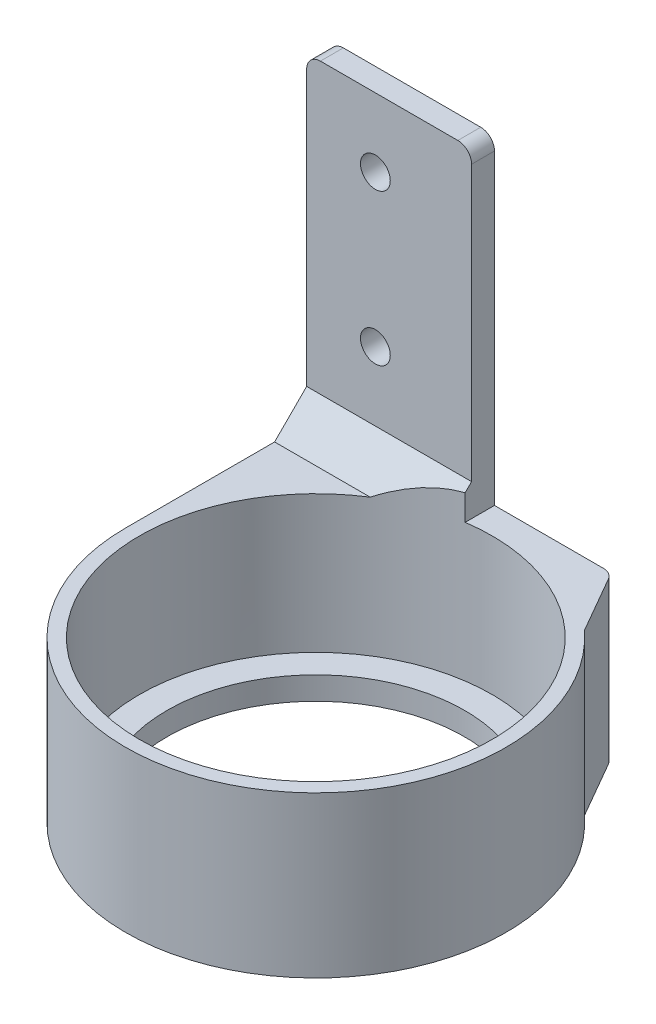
ISO-10303-21;
HEADER;
FILE_DESCRIPTION(('STEP AP214'),'2;1');
FILE_NAME('part.step','',(''),(''),'','','');
FILE_SCHEMA(('AUTOMOTIVE_DESIGN { 1 0 10303 214 1 1 1 1 }'));
ENDSEC;
DATA;
#1=APPLICATION_CONTEXT('core data for automotive mechanical design processes');
#2=APPLICATION_PROTOCOL_DEFINITION('international standard','automotive_design',2000,#1);
#3=PRODUCT_CONTEXT('',#1,'mechanical');
#4=PRODUCT('Part','Part','',(#3));
#5=PRODUCT_RELATED_PRODUCT_CATEGORY('part','',(#4));
#6=PRODUCT_DEFINITION_FORMATION('','',#4);
#7=PRODUCT_DEFINITION_CONTEXT('part definition',#1,'design');
#8=PRODUCT_DEFINITION('design','',#6,#7);
#9=PRODUCT_DEFINITION_SHAPE('','',#8);
#10=(LENGTH_UNIT() NAMED_UNIT(*) SI_UNIT(.MILLI.,.METRE.));
#11=(NAMED_UNIT(*) PLANE_ANGLE_UNIT() SI_UNIT($,.RADIAN.));
#12=(NAMED_UNIT(*) SI_UNIT($,.STERADIAN.) SOLID_ANGLE_UNIT());
#13=UNCERTAINTY_MEASURE_WITH_UNIT(LENGTH_MEASURE(1.E-05),#10,'distance_accuracy_value','');
#14=(GEOMETRIC_REPRESENTATION_CONTEXT(3) GLOBAL_UNCERTAINTY_ASSIGNED_CONTEXT((#13)) GLOBAL_UNIT_ASSIGNED_CONTEXT((#10,
#11,#12)) REPRESENTATION_CONTEXT('',''));
#15=CARTESIAN_POINT('',(0.,0.,0.));
#16=DIRECTION('',(0.,0.,1.));
#17=DIRECTION('',(1.,0.,0.));
#18=AXIS2_PLACEMENT_3D('',#15,#16,#17);
#19=CARTESIAN_POINT('',(36.,-3.00000000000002,3.));
#20=DIRECTION('',(-1.,0.,0.));
#21=DIRECTION('',(0.,-1.,0.));
#22=AXIS2_PLACEMENT_3D('',#19,#20,#21);
#23=PLANE('',#22);
#24=DIRECTION('',(0.,-1.,0.));
#25=VECTOR('',#24,1.);
#26=CARTESIAN_POINT('',(36.,-60.,6.39488223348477));
#27=LINE('',#26,#25);
#28=CARTESIAN_POINT('',(36.,-70.,6.39488223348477));
#29=VERTEX_POINT('',#28);
#30=CARTESIAN_POINT('',(36.,-64.3948822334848,6.39488223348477));
#31=VERTEX_POINT('',#30);
#32=EDGE_CURVE('E68',#29,#31,#27,.F.);
#33=ORIENTED_EDGE('',*,*,#32,.F.);
#34=DIRECTION('',(0.,0.,-1.));
#35=VECTOR('',#34,1.);
#36=CARTESIAN_POINT('',(36.,-70.,3.));
#37=LINE('',#36,#35);
#38=CARTESIAN_POINT('',(36.,-70.,0.));
#39=VERTEX_POINT('',#38);
#40=EDGE_CURVE('E143',#29,#39,#37,.T.);
#41=ORIENTED_EDGE('',*,*,#40,.T.);
#42=DIRECTION('',(0.,1.,0.));
#43=VECTOR('',#42,1.);
#44=CARTESIAN_POINT('',(36.,-3.00000000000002,0.));
#45=LINE('',#44,#43);
#46=CARTESIAN_POINT('',(36.,-3.00000000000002,0.));
#47=VERTEX_POINT('',#46);
#48=EDGE_CURVE('E210',#39,#47,#45,.T.);
#49=ORIENTED_EDGE('',*,*,#48,.T.);
#50=DIRECTION('',(0.,0.,-1.));
#51=VECTOR('',#50,1.);
#52=CARTESIAN_POINT('',(36.,-3.00000000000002,3.));
#53=LINE('',#52,#51);
#54=CARTESIAN_POINT('',(36.,-3.00000000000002,5.));
#55=VERTEX_POINT('',#54);
#56=EDGE_CURVE('E244',#55,#47,#53,.T.);
#57=ORIENTED_EDGE('',*,*,#56,.F.);
#58=DIRECTION('',(0.,1.,0.));
#59=VECTOR('',#58,1.);
#60=CARTESIAN_POINT('',(36.,-3.00000000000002,5.));
#61=LINE('',#60,#59);
#62=CARTESIAN_POINT('',(36.,-63.,5.));
#63=VERTEX_POINT('',#62);
#64=EDGE_CURVE('E330',#63,#55,#61,.T.);
#65=ORIENTED_EDGE('',*,*,#64,.F.);
#66=DIRECTION('',(0.,0.707106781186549,-0.707106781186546));
#67=VECTOR('',#66,1.);
#68=CARTESIAN_POINT('',(36.,-63.,5.));
#69=LINE('',#68,#67);
#70=EDGE_CURVE('E146',#31,#63,#69,.T.);
#71=ORIENTED_EDGE('',*,*,#70,.F.);
#72=EDGE_LOOP('',(#33,#41,#49,#57,#65,#71));
#73=FACE_BOUND('',#72,.T.);
#74=ADVANCED_FACE('F52',(#73),#23,.F.);
#75=CARTESIAN_POINT('',(36.,-63.,5.));
#76=DIRECTION('',(0.,0.707106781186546,0.707106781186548));
#77=DIRECTION('',(0.,-0.707106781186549,0.707106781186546));
#78=AXIS2_PLACEMENT_3D('',#75,#76,#77);
#79=PLANE('',#78);
#80=DIRECTION('',(-1.,0.,0.));
#81=VECTOR('',#80,1.);
#82=CARTESIAN_POINT('',(36.,-70.,12.));
#83=LINE('',#82,#81);
#84=CARTESIAN_POINT('',(20.8602325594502,-70.,12.));
#85=VERTEX_POINT('',#84);
#86=CARTESIAN_POINT('',(0.,-70.,12.));
#87=VERTEX_POINT('',#86);
#88=EDGE_CURVE('E75',#85,#87,#83,.T.);
#89=ORIENTED_EDGE('',*,*,#88,.F.);
#90=CARTESIAN_POINT('',(41.5000000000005,-102.5,44.5));
#91=DIRECTION('',(0.,0.707106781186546,0.707106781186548));
#92=DIRECTION('',(0.,-0.707106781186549,0.707106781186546));
#93=AXIS2_PLACEMENT_3D('',#90,#91,#92);
#94=ELLIPSE('',#93,54.4472221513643,38.5);
#95=EDGE_CURVE('E12',#85,#31,#94,.F.);
#96=ORIENTED_EDGE('',*,*,#95,.T.);
#97=ORIENTED_EDGE('',*,*,#70,.T.);
#98=DIRECTION('',(-1.,0.,0.));
#99=VECTOR('',#98,1.);
#100=CARTESIAN_POINT('',(36.,-63.,5.));
#101=LINE('',#100,#99);
#102=CARTESIAN_POINT('',(0.,-63.,5.));
#103=VERTEX_POINT('',#102);
#104=EDGE_CURVE('E349',#63,#103,#101,.T.);
#105=ORIENTED_EDGE('',*,*,#104,.T.);
#106=DIRECTION('',(0.,0.707106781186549,-0.707106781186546));
#107=VECTOR('',#106,1.);
#108=CARTESIAN_POINT('',(0.,-63.,5.));
#109=LINE('',#108,#107);
#110=EDGE_CURVE('E148',#87,#103,#109,.T.);
#111=ORIENTED_EDGE('',*,*,#110,.F.);
#112=EDGE_LOOP('',(#89,#96,#97,#105,#111));
#113=FACE_BOUND('',#112,.T.);
#114=ADVANCED_FACE('F280',(#113),#79,.T.);
#115=CARTESIAN_POINT('',(41.5,-70.,44.5));
#116=DIRECTION('',(0.,-1.,0.));
#117=DIRECTION('',(0.,0.,-1.));
#118=AXIS2_PLACEMENT_3D('',#115,#116,#117);
#119=PLANE('',#118);
#120=CARTESIAN_POINT('',(41.5000000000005,-70.,44.5));
#121=DIRECTION('',(0.,-1.,0.));
#122=DIRECTION('',(0.,0.,-1.));
#123=AXIS2_PLACEMENT_3D('',#120,#121,#122);
#124=CIRCLE('',#123,38.5);
#125=EDGE_CURVE('E152',#29,#85,#124,.T.);
#126=ORIENTED_EDGE('',*,*,#125,.T.);
#127=ORIENTED_EDGE('',*,*,#88,.T.);
#128=DIRECTION('',(0.,0.,-1.));
#129=VECTOR('',#128,1.);
#130=CARTESIAN_POINT('',(0.,-70.,3.));
#131=LINE('',#130,#129);
#132=CARTESIAN_POINT('',(0.,-70.,44.5000000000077));
#133=VERTEX_POINT('',#132);
#134=EDGE_CURVE('E185',#133,#87,#131,.T.);
#135=ORIENTED_EDGE('',*,*,#134,.F.);
#136=CARTESIAN_POINT('',(41.5,-70.,44.5));
#137=DIRECTION('',(0.,-1.,0.));
#138=DIRECTION('',(0.,0.,-1.));
#139=AXIS2_PLACEMENT_3D('',#136,#137,#138);
#140=CIRCLE('',#139,41.5);
#141=CARTESIAN_POINT('',(69.453110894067,-69.9999999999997,13.826337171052));
#142=VERTEX_POINT('',#141);
#143=EDGE_CURVE('E61',#142,#133,#140,.T.);
#144=ORIENTED_EDGE('',*,*,#143,.F.);
#145=DIRECTION('',(-0.498610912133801,0.,-0.866825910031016));
#146=VECTOR('',#145,1.);
#147=CARTESIAN_POINT('',(46.2103102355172,-69.9999999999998,-26.5808447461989));
#148=LINE('',#147,#146);
#149=CARTESIAN_POINT('',(62.3652189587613,-70.,1.50416726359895));
#150=VERTEX_POINT('',#149);
#151=EDGE_CURVE('E249',#142,#150,#148,.T.);
#152=ORIENTED_EDGE('',*,*,#151,.T.);
#153=CARTESIAN_POINT('',(59.7647412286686,-70.,3.));
#154=DIRECTION('',(0.,1.,0.));
#155=DIRECTION('',(0.,0.,1.));
#156=AXIS2_PLACEMENT_3D('',#153,#154,#155);
#157=CIRCLE('',#156,2.99999999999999);
#158=CARTESIAN_POINT('',(59.7647412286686,-70.,0.));
#159=VERTEX_POINT('',#158);
#160=EDGE_CURVE('E313',#159,#150,#157,.F.);
#161=ORIENTED_EDGE('',*,*,#160,.F.);
#162=DIRECTION('',(1.,0.,0.));
#163=VECTOR('',#162,1.);
#164=CARTESIAN_POINT('',(36.,-70.,0.));
#165=LINE('',#164,#163);
#166=EDGE_CURVE('E155',#39,#159,#165,.T.);
#167=ORIENTED_EDGE('',*,*,#166,.F.);
#168=ORIENTED_EDGE('',*,*,#40,.F.);
#169=EDGE_LOOP('',(#126,#127,#135,#144,#152,#161,#167,#168));
#170=FACE_BOUND('',#169,.T.);
#171=ADVANCED_FACE('F151',(#170),#119,.F.);
#172=CARTESIAN_POINT('',(41.5,-105.,44.5));
#173=DIRECTION('',(0.,-1.,0.));
#174=DIRECTION('',(0.,0.,-1.));
#175=AXIS2_PLACEMENT_3D('',#172,#173,#174);
#176=PLANE('',#175);
#177=CARTESIAN_POINT('',(41.5000000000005,-105.,44.5));
#178=DIRECTION('',(0.,1.,0.));
#179=DIRECTION('',(0.,0.,1.));
#180=AXIS2_PLACEMENT_3D('',#177,#178,#179);
#181=CIRCLE('',#180,32.5);
#182=CARTESIAN_POINT('',(41.5000000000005,-105.,77.));
#183=VERTEX_POINT('',#182);
#184=EDGE_CURVE('E168',#183,#183,#181,.T.);
#185=ORIENTED_EDGE('',*,*,#184,.T.);
#186=EDGE_LOOP('',(#185));
#187=FACE_BOUND('',#186,.T.);
#188=CARTESIAN_POINT('',(59.7647412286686,-105.,3.));
#189=DIRECTION('',(0.,1.,0.));
#190=DIRECTION('',(0.,0.,1.));
#191=AXIS2_PLACEMENT_3D('',#188,#189,#190);
#192=CIRCLE('',#191,2.99999999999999);
#193=CARTESIAN_POINT('',(59.7647412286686,-105.,0.));
#194=VERTEX_POINT('',#193);
#195=CARTESIAN_POINT('',(62.3652189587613,-105.,1.50416726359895));
#196=VERTEX_POINT('',#195);
#197=EDGE_CURVE('E309',#194,#196,#192,.F.);
#198=ORIENTED_EDGE('',*,*,#197,.T.);
#199=DIRECTION('',(-0.498610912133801,0.,-0.866825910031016));
#200=VECTOR('',#199,1.);
#201=CARTESIAN_POINT('',(46.2103102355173,-105.,-26.5808447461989));
#202=LINE('',#201,#200);
#203=CARTESIAN_POINT('',(69.4531108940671,-105.,13.826337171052));
#204=VERTEX_POINT('',#203);
#205=EDGE_CURVE('E248',#204,#196,#202,.T.);
#206=ORIENTED_EDGE('',*,*,#205,.F.);
#207=CARTESIAN_POINT('',(41.5,-105.,44.5));
#208=DIRECTION('',(0.,-1.,0.));
#209=DIRECTION('',(0.,0.,-1.));
#210=AXIS2_PLACEMENT_3D('',#207,#208,#209);
#211=CIRCLE('',#210,41.5);
#212=CARTESIAN_POINT('',(0.,-105.,44.5000000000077));
#213=VERTEX_POINT('',#212);
#214=EDGE_CURVE('E161',#204,#213,#211,.T.);
#215=ORIENTED_EDGE('',*,*,#214,.T.);
#216=DIRECTION('',(0.,0.,-1.));
#217=VECTOR('',#216,1.);
#218=CARTESIAN_POINT('',(0.,-105.,3.));
#219=LINE('',#218,#217);
#220=CARTESIAN_POINT('',(0.,-105.,0.));
#221=VERTEX_POINT('',#220);
#222=EDGE_CURVE('E189',#213,#221,#219,.T.);
#223=ORIENTED_EDGE('',*,*,#222,.T.);
#224=DIRECTION('',(1.,0.,0.));
#225=VECTOR('',#224,1.);
#226=CARTESIAN_POINT('',(33.,-105.,0.));
#227=LINE('',#226,#225);
#228=EDGE_CURVE('E226',#221,#194,#227,.T.);
#229=ORIENTED_EDGE('',*,*,#228,.T.);
#230=EDGE_LOOP('',(#198,#206,#215,#223,#229));
#231=FACE_BOUND('',#230,.T.);
#232=ADVANCED_FACE('F294',(#187,#231),#176,.T.);
#233=CARTESIAN_POINT('',(46.2103102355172,-69.9999999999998,-26.5808447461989));
#234=DIRECTION('',(-0.866825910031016,0.,0.498610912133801));
#235=DIRECTION('',(0.498610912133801,0.,0.866825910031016));
#236=AXIS2_PLACEMENT_3D('',#233,#234,#235);
#237=PLANE('',#236);
#238=DIRECTION('',(0.,1.,0.));
#239=VECTOR('',#238,1.);
#240=CARTESIAN_POINT('',(62.3652189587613,-105.,1.50416726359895));
#241=LINE('',#240,#239);
#242=EDGE_CURVE('E193',#196,#150,#241,.T.);
#243=ORIENTED_EDGE('',*,*,#242,.T.);
#244=ORIENTED_EDGE('',*,*,#151,.F.);
#245=DIRECTION('',(0.,-1.,0.));
#246=VECTOR('',#245,1.);
#247=CARTESIAN_POINT('',(69.453110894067,-69.9999999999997,13.826337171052));
#248=LINE('',#247,#246);
#249=EDGE_CURVE('E180',#142,#204,#248,.T.);
#250=ORIENTED_EDGE('',*,*,#249,.T.);
#251=ORIENTED_EDGE('',*,*,#205,.T.);
#252=EDGE_LOOP('',(#243,#244,#250,#251));
#253=FACE_BOUND('',#252,.T.);
#254=ADVANCED_FACE('F291',(#253),#237,.F.);
#255=CARTESIAN_POINT('',(33.,-3.,0.));
#256=DIRECTION('',(0.,0.,-1.));
#257=DIRECTION('',(-1.,0.,0.));
#258=AXIS2_PLACEMENT_3D('',#255,#256,#257);
#259=PLANE('',#258);
#260=CARTESIAN_POINT('',(15.,-15.,0.));
#261=DIRECTION('',(0.,0.,1.));
#262=DIRECTION('',(1.,0.,0.));
#263=AXIS2_PLACEMENT_3D('',#260,#261,#262);
#264=CIRCLE('',#263,3.25);
#265=CARTESIAN_POINT('',(18.25,-15.,0.));
#266=VERTEX_POINT('',#265);
#267=EDGE_CURVE('E206',#266,#266,#264,.T.);
#268=ORIENTED_EDGE('',*,*,#267,.T.);
#269=EDGE_LOOP('',(#268));
#270=FACE_BOUND('',#269,.T.);
#271=CARTESIAN_POINT('',(15.,-48.,0.));
#272=DIRECTION('',(0.,0.,1.));
#273=DIRECTION('',(1.,0.,0.));
#274=AXIS2_PLACEMENT_3D('',#271,#272,#273);
#275=CIRCLE('',#274,3.25000000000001);
#276=CARTESIAN_POINT('',(18.25,-48.,0.));
#277=VERTEX_POINT('',#276);
#278=EDGE_CURVE('E157',#277,#277,#275,.T.);
#279=ORIENTED_EDGE('',*,*,#278,.T.);
#280=EDGE_LOOP('',(#279));
#281=FACE_BOUND('',#280,.T.);
#282=ORIENTED_EDGE('',*,*,#166,.T.);
#283=DIRECTION('',(0.,1.,0.));
#284=VECTOR('',#283,1.);
#285=CARTESIAN_POINT('',(59.7647412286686,-105.,0.));
#286=LINE('',#285,#284);
#287=EDGE_CURVE('E197',#194,#159,#286,.T.);
#288=ORIENTED_EDGE('',*,*,#287,.F.);
#289=ORIENTED_EDGE('',*,*,#228,.F.);
#290=DIRECTION('',(0.,-1.,0.));
#291=VECTOR('',#290,1.);
#292=CARTESIAN_POINT('',(0.,-97.,0.));
#293=LINE('',#292,#291);
#294=CARTESIAN_POINT('',(0.,-3.00000000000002,0.));
#295=VERTEX_POINT('',#294);
#296=EDGE_CURVE('E223',#295,#221,#293,.T.);
#297=ORIENTED_EDGE('',*,*,#296,.F.);
#298=CARTESIAN_POINT('',(3.,-3.,0.));
#299=DIRECTION('',(0.,0.,1.));
#300=DIRECTION('',(1.,0.,0.));
#301=AXIS2_PLACEMENT_3D('',#298,#299,#300);
#302=CIRCLE('',#301,3.);
#303=CARTESIAN_POINT('',(3.00000000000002,0.,0.));
#304=VERTEX_POINT('',#303);
#305=EDGE_CURVE('E219',#304,#295,#302,.T.);
#306=ORIENTED_EDGE('',*,*,#305,.F.);
#307=DIRECTION('',(-1.,0.,0.));
#308=VECTOR('',#307,1.);
#309=CARTESIAN_POINT('',(3.00000000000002,0.,0.));
#310=LINE('',#309,#308);
#311=CARTESIAN_POINT('',(33.,0.,0.));
#312=VERTEX_POINT('',#311);
#313=EDGE_CURVE('E216',#312,#304,#310,.T.);
#314=ORIENTED_EDGE('',*,*,#313,.F.);
#315=CARTESIAN_POINT('',(33.,-3.,0.));
#316=DIRECTION('',(0.,0.,1.));
#317=DIRECTION('',(-1.,0.,0.));
#318=AXIS2_PLACEMENT_3D('',#315,#316,#317);
#319=CIRCLE('',#318,3.);
#320=EDGE_CURVE('E213',#47,#312,#319,.T.);
#321=ORIENTED_EDGE('',*,*,#320,.F.);
#322=ORIENTED_EDGE('',*,*,#48,.F.);
#323=EDGE_LOOP('',(#282,#288,#289,#297,#306,#314,#321,#322));
#324=FACE_BOUND('',#323,.T.);
#325=ADVANCED_FACE('F277',(#270,#281,#324),#259,.T.);
#326=CARTESIAN_POINT('',(41.5,-70.,44.5));
#327=DIRECTION('',(0.,-1.,0.));
#328=DIRECTION('',(0.,0.,-1.));
#329=AXIS2_PLACEMENT_3D('',#326,#327,#328);
#330=CYLINDRICAL_SURFACE('',#329,41.5);
#331=DIRECTION('',(0.,-1.,0.));
#332=VECTOR('',#331,1.);
#333=CARTESIAN_POINT('',(4.71844785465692E-13,-70.,44.4999999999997));
#334=LINE('',#333,#332);
#335=EDGE_CURVE('E179',#133,#213,#334,.T.);
#336=ORIENTED_EDGE('',*,*,#335,.T.);
#337=ORIENTED_EDGE('',*,*,#214,.F.);
#338=ORIENTED_EDGE('',*,*,#249,.F.);
#339=ORIENTED_EDGE('',*,*,#143,.T.);
#340=EDGE_LOOP('',(#336,#337,#338,#339));
#341=FACE_BOUND('',#340,.T.);
#342=ADVANCED_FACE('F54',(#341),#330,.T.);
#343=CARTESIAN_POINT('',(41.5000000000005,0.,44.5));
#344=DIRECTION('',(0.,-1.,0.));
#345=DIRECTION('',(0.,0.,-1.));
#346=AXIS2_PLACEMENT_3D('',#343,#344,#345);
#347=CYLINDRICAL_SURFACE('',#346,38.5);
#348=CARTESIAN_POINT('',(41.5000000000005,-100.,44.5));
#349=DIRECTION('',(0.,1.,0.));
#350=DIRECTION('',(1.,0.,0.));
#351=AXIS2_PLACEMENT_3D('',#348,#349,#350);
#352=CIRCLE('',#351,38.5);
#353=CARTESIAN_POINT('',(80.0000000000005,-100.,44.5));
#354=VERTEX_POINT('',#353);
#355=EDGE_CURVE('E162',#354,#354,#352,.T.);
#356=ORIENTED_EDGE('',*,*,#355,.F.);
#357=EDGE_LOOP('',(#356));
#358=FACE_BOUND('',#357,.T.);
#359=ORIENTED_EDGE('',*,*,#125,.F.);
#360=ORIENTED_EDGE('',*,*,#32,.T.);
#361=ORIENTED_EDGE('',*,*,#95,.F.);
#362=EDGE_LOOP('',(#359,#360,#361));
#363=FACE_BOUND('',#362,.T.);
#364=ADVANCED_FACE('F159',(#358,#363),#347,.F.);
#365=CARTESIAN_POINT('',(41.5000000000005,-100.,44.5));
#366=DIRECTION('',(0.,1.,0.));
#367=DIRECTION('',(0.,0.,1.));
#368=AXIS2_PLACEMENT_3D('',#365,#366,#367);
#369=PLANE('',#368);
#370=CARTESIAN_POINT('',(41.5000000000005,-100.,44.5));
#371=DIRECTION('',(0.,1.,0.));
#372=DIRECTION('',(0.,0.,1.));
#373=AXIS2_PLACEMENT_3D('',#370,#371,#372);
#374=CIRCLE('',#373,32.5);
#375=CARTESIAN_POINT('',(41.5000000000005,-100.,77.));
#376=VERTEX_POINT('',#375);
#377=EDGE_CURVE('E257',#376,#376,#374,.T.);
#378=ORIENTED_EDGE('',*,*,#377,.F.);
#379=EDGE_LOOP('',(#378));
#380=FACE_BOUND('',#379,.T.);
#381=ORIENTED_EDGE('',*,*,#355,.T.);
#382=EDGE_LOOP('',(#381));
#383=FACE_BOUND('',#382,.T.);
#384=ADVANCED_FACE('F266',(#380,#383),#369,.T.);
#385=CARTESIAN_POINT('',(41.5000000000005,-105.,44.5));
#386=DIRECTION('',(0.,1.,0.));
#387=DIRECTION('',(0.,0.,1.));
#388=AXIS2_PLACEMENT_3D('',#385,#386,#387);
#389=CYLINDRICAL_SURFACE('',#388,32.5);
#390=ORIENTED_EDGE('',*,*,#184,.F.);
#391=EDGE_LOOP('',(#390));
#392=FACE_BOUND('',#391,.T.);
#393=ORIENTED_EDGE('',*,*,#377,.T.);
#394=EDGE_LOOP('',(#393));
#395=FACE_BOUND('',#394,.T.);
#396=ADVANCED_FACE('F264',(#392,#395),#389,.F.);
#397=CARTESIAN_POINT('',(33.,-3.,3.));
#398=DIRECTION('',(0.,0.,-1.));
#399=DIRECTION('',(-1.,0.,0.));
#400=AXIS2_PLACEMENT_3D('',#397,#398,#399);
#401=CYLINDRICAL_SURFACE('',#400,3.);
#402=ORIENTED_EDGE('',*,*,#320,.T.);
#403=DIRECTION('',(0.,0.,-1.));
#404=VECTOR('',#403,1.);
#405=CARTESIAN_POINT('',(33.,0.,3.));
#406=LINE('',#405,#404);
#407=CARTESIAN_POINT('',(33.,0.,5.));
#408=VERTEX_POINT('',#407);
#409=EDGE_CURVE('E240',#408,#312,#406,.T.);
#410=ORIENTED_EDGE('',*,*,#409,.F.);
#411=CARTESIAN_POINT('',(33.,-3.,5.));
#412=DIRECTION('',(0.,0.,1.));
#413=DIRECTION('',(-1.,0.,0.));
#414=AXIS2_PLACEMENT_3D('',#411,#412,#413);
#415=CIRCLE('',#414,3.);
#416=EDGE_CURVE('E324',#55,#408,#415,.T.);
#417=ORIENTED_EDGE('',*,*,#416,.F.);
#418=ORIENTED_EDGE('',*,*,#56,.T.);
#419=EDGE_LOOP('',(#402,#410,#417,#418));
#420=FACE_BOUND('',#419,.T.);
#421=ADVANCED_FACE('F289',(#420),#401,.T.);
#422=CARTESIAN_POINT('',(3.00000000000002,0.,3.));
#423=DIRECTION('',(0.,-1.,0.));
#424=DIRECTION('',(0.,0.,-1.));
#425=AXIS2_PLACEMENT_3D('',#422,#423,#424);
#426=PLANE('',#425);
#427=ORIENTED_EDGE('',*,*,#313,.T.);
#428=DIRECTION('',(0.,0.,-1.));
#429=VECTOR('',#428,1.);
#430=CARTESIAN_POINT('',(3.00000000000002,0.,3.));
#431=LINE('',#430,#429);
#432=CARTESIAN_POINT('',(3.00000000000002,0.,5.));
#433=VERTEX_POINT('',#432);
#434=EDGE_CURVE('E236',#433,#304,#431,.T.);
#435=ORIENTED_EDGE('',*,*,#434,.F.);
#436=DIRECTION('',(-1.,0.,0.));
#437=VECTOR('',#436,1.);
#438=CARTESIAN_POINT('',(3.00000000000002,0.,5.));
#439=LINE('',#438,#437);
#440=EDGE_CURVE('E329',#408,#433,#439,.T.);
#441=ORIENTED_EDGE('',*,*,#440,.F.);
#442=ORIENTED_EDGE('',*,*,#409,.T.);
#443=EDGE_LOOP('',(#427,#435,#441,#442));
#444=FACE_BOUND('',#443,.T.);
#445=ADVANCED_FACE('F301',(#444),#426,.F.);
#446=CARTESIAN_POINT('',(3.,-3.,3.));
#447=DIRECTION('',(0.,0.,-1.));
#448=DIRECTION('',(-1.,0.,0.));
#449=AXIS2_PLACEMENT_3D('',#446,#447,#448);
#450=CYLINDRICAL_SURFACE('',#449,3.);
#451=ORIENTED_EDGE('',*,*,#305,.T.);
#452=DIRECTION('',(0.,0.,-1.));
#453=VECTOR('',#452,1.);
#454=CARTESIAN_POINT('',(0.,-3.00000000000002,3.));
#455=LINE('',#454,#453);
#456=CARTESIAN_POINT('',(0.,-3.00000000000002,5.));
#457=VERTEX_POINT('',#456);
#458=EDGE_CURVE('E232',#457,#295,#455,.T.);
#459=ORIENTED_EDGE('',*,*,#458,.F.);
#460=CARTESIAN_POINT('',(3.,-3.,5.));
#461=DIRECTION('',(0.,0.,1.));
#462=DIRECTION('',(1.,0.,0.));
#463=AXIS2_PLACEMENT_3D('',#460,#461,#462);
#464=CIRCLE('',#463,3.);
#465=EDGE_CURVE('E334',#433,#457,#464,.T.);
#466=ORIENTED_EDGE('',*,*,#465,.F.);
#467=ORIENTED_EDGE('',*,*,#434,.T.);
#468=EDGE_LOOP('',(#451,#459,#466,#467));
#469=FACE_BOUND('',#468,.T.);
#470=ADVANCED_FACE('F392',(#469),#450,.T.);
#471=CARTESIAN_POINT('',(0.,-97.,3.));
#472=DIRECTION('',(1.,0.,0.));
#473=DIRECTION('',(0.,1.,0.));
#474=AXIS2_PLACEMENT_3D('',#471,#472,#473);
#475=PLANE('',#474);
#476=ORIENTED_EDGE('',*,*,#134,.T.);
#477=ORIENTED_EDGE('',*,*,#110,.T.);
#478=DIRECTION('',(0.,-1.,0.));
#479=VECTOR('',#478,1.);
#480=CARTESIAN_POINT('',(0.,-3.00000000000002,5.));
#481=LINE('',#480,#479);
#482=EDGE_CURVE('E316',#457,#103,#481,.T.);
#483=ORIENTED_EDGE('',*,*,#482,.F.);
#484=ORIENTED_EDGE('',*,*,#458,.T.);
#485=ORIENTED_EDGE('',*,*,#296,.T.);
#486=ORIENTED_EDGE('',*,*,#222,.F.);
#487=ORIENTED_EDGE('',*,*,#335,.F.);
#488=EDGE_LOOP('',(#476,#477,#483,#484,#485,#486,#487));
#489=FACE_BOUND('',#488,.T.);
#490=ADVANCED_FACE('F183',(#489),#475,.F.);
#491=CARTESIAN_POINT('',(15.,-15.,3.));
#492=DIRECTION('',(0.,0.,-1.));
#493=DIRECTION('',(-1.,0.,0.));
#494=AXIS2_PLACEMENT_3D('',#491,#492,#493);
#495=CYLINDRICAL_SURFACE('',#494,3.25);
#496=ORIENTED_EDGE('',*,*,#267,.F.);
#497=EDGE_LOOP('',(#496));
#498=FACE_BOUND('',#497,.T.);
#499=CARTESIAN_POINT('',(15.,-15.,5.));
#500=DIRECTION('',(0.,0.,1.));
#501=DIRECTION('',(1.,0.,0.));
#502=AXIS2_PLACEMENT_3D('',#499,#500,#501);
#503=CIRCLE('',#502,3.25);
#504=CARTESIAN_POINT('',(18.25,-15.,5.));
#505=VERTEX_POINT('',#504);
#506=EDGE_CURVE('E336',#505,#505,#503,.T.);
#507=ORIENTED_EDGE('',*,*,#506,.T.);
#508=EDGE_LOOP('',(#507));
#509=FACE_BOUND('',#508,.T.);
#510=ADVANCED_FACE('F367',(#498,#509),#495,.F.);
#511=CARTESIAN_POINT('',(15.,-48.,3.));
#512=DIRECTION('',(0.,0.,-1.));
#513=DIRECTION('',(-1.,0.,0.));
#514=AXIS2_PLACEMENT_3D('',#511,#512,#513);
#515=CYLINDRICAL_SURFACE('',#514,3.25000000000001);
#516=ORIENTED_EDGE('',*,*,#278,.F.);
#517=EDGE_LOOP('',(#516));
#518=FACE_BOUND('',#517,.T.);
#519=CARTESIAN_POINT('',(15.,-48.,5.));
#520=DIRECTION('',(0.,0.,1.));
#521=DIRECTION('',(1.,0.,0.));
#522=AXIS2_PLACEMENT_3D('',#519,#520,#521);
#523=CIRCLE('',#522,3.25000000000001);
#524=CARTESIAN_POINT('',(18.25,-48.,5.));
#525=VERTEX_POINT('',#524);
#526=EDGE_CURVE('E352',#525,#525,#523,.T.);
#527=ORIENTED_EDGE('',*,*,#526,.T.);
#528=EDGE_LOOP('',(#527));
#529=FACE_BOUND('',#528,.T.);
#530=ADVANCED_FACE('F374',(#518,#529),#515,.F.);
#531=CARTESIAN_POINT('',(59.7647412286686,-105.,3.));
#532=DIRECTION('',(0.,1.,0.));
#533=DIRECTION('',(0.,0.,1.));
#534=AXIS2_PLACEMENT_3D('',#531,#532,#533);
#535=CYLINDRICAL_SURFACE('',#534,2.99999999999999);
#536=ORIENTED_EDGE('',*,*,#160,.T.);
#537=ORIENTED_EDGE('',*,*,#242,.F.);
#538=ORIENTED_EDGE('',*,*,#197,.F.);
#539=ORIENTED_EDGE('',*,*,#287,.T.);
#540=EDGE_LOOP('',(#536,#537,#538,#539));
#541=FACE_BOUND('',#540,.T.);
#542=ADVANCED_FACE('F370',(#541),#535,.T.);
#543=CARTESIAN_POINT('',(3.,-3.,5.));
#544=DIRECTION('',(0.,0.,1.));
#545=DIRECTION('',(1.,0.,0.));
#546=AXIS2_PLACEMENT_3D('',#543,#544,#545);
#547=PLANE('',#546);
#548=ORIENTED_EDGE('',*,*,#104,.F.);
#549=ORIENTED_EDGE('',*,*,#64,.T.);
#550=ORIENTED_EDGE('',*,*,#416,.T.);
#551=ORIENTED_EDGE('',*,*,#440,.T.);
#552=ORIENTED_EDGE('',*,*,#465,.T.);
#553=ORIENTED_EDGE('',*,*,#482,.T.);
#554=EDGE_LOOP('',(#548,#549,#550,#551,#552,#553));
#555=FACE_BOUND('',#554,.T.);
#556=ORIENTED_EDGE('',*,*,#506,.F.);
#557=EDGE_LOOP('',(#556));
#558=FACE_BOUND('',#557,.T.);
#559=ORIENTED_EDGE('',*,*,#526,.F.);
#560=EDGE_LOOP('',(#559));
#561=FACE_BOUND('',#560,.T.);
#562=ADVANCED_FACE('F347',(#555,#558,#561),#547,.T.);
#563=CLOSED_SHELL('',(#74,#114,#171,#232,#254,#325,#342,#364,#384,#396,#421,#445,#470,#490,#510,
#530,#542,#562));
#564=MANIFOLD_SOLID_BREP('B2',#563);
#565=ADVANCED_BREP_SHAPE_REPRESENTATION('',(#18,#564),#14);
#566=SHAPE_DEFINITION_REPRESENTATION(#9,#565);
ENDSEC;
END-ISO-10303-21;
